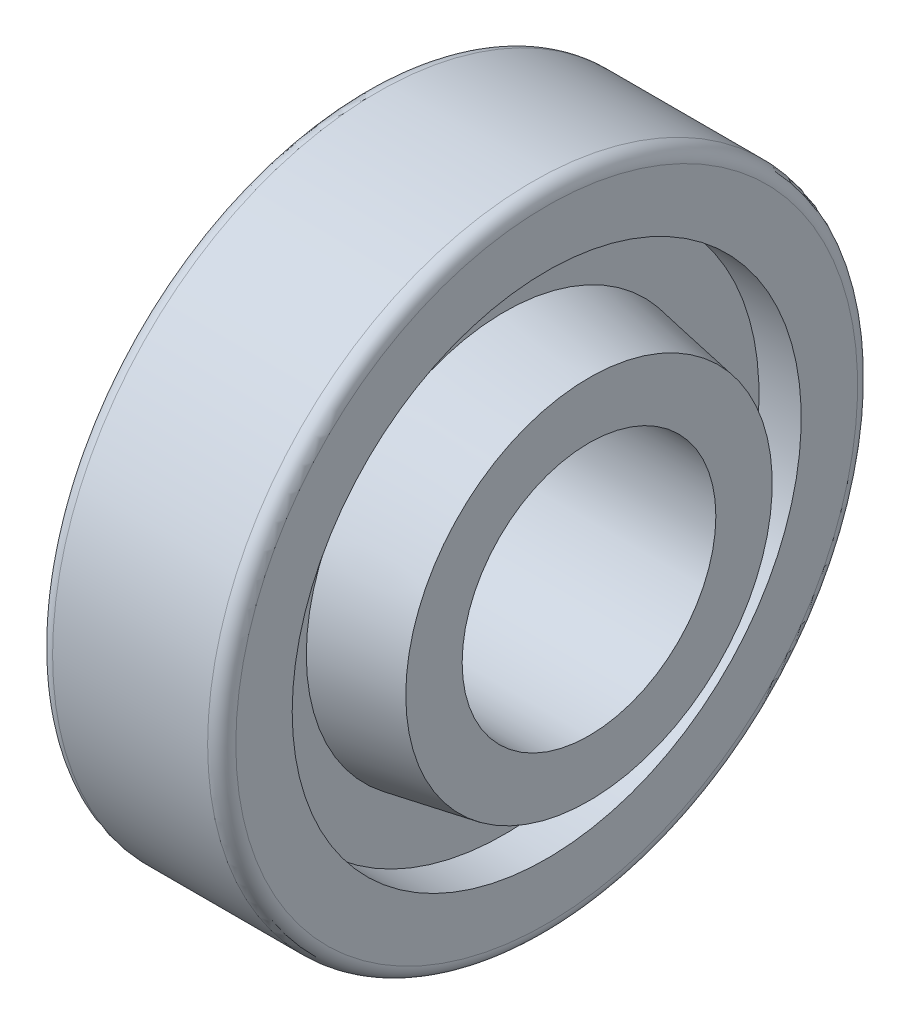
ISO-10303-21;
HEADER;
FILE_DESCRIPTION(('STEP AP214'),'2;1');
FILE_NAME('part.step','',(''),(''),'','','');
FILE_SCHEMA(('AUTOMOTIVE_DESIGN { 1 0 10303 214 1 1 1 1 }'));
ENDSEC;
DATA;
#1=APPLICATION_CONTEXT('core data for automotive mechanical design processes');
#2=APPLICATION_PROTOCOL_DEFINITION('international standard','automotive_design',2000,#1);
#3=PRODUCT_CONTEXT('',#1,'mechanical');
#4=PRODUCT('Part','Part','',(#3));
#5=PRODUCT_RELATED_PRODUCT_CATEGORY('part','',(#4));
#6=PRODUCT_DEFINITION_FORMATION('','',#4);
#7=PRODUCT_DEFINITION_CONTEXT('part definition',#1,'design');
#8=PRODUCT_DEFINITION('design','',#6,#7);
#9=PRODUCT_DEFINITION_SHAPE('','',#8);
#10=(LENGTH_UNIT() NAMED_UNIT(*) SI_UNIT(.MILLI.,.METRE.));
#11=(NAMED_UNIT(*) PLANE_ANGLE_UNIT() SI_UNIT($,.RADIAN.));
#12=(NAMED_UNIT(*) SI_UNIT($,.STERADIAN.) SOLID_ANGLE_UNIT());
#13=UNCERTAINTY_MEASURE_WITH_UNIT(LENGTH_MEASURE(1.E-05),#10,'distance_accuracy_value','');
#14=(GEOMETRIC_REPRESENTATION_CONTEXT(3) GLOBAL_UNCERTAINTY_ASSIGNED_CONTEXT((#13)) GLOBAL_UNIT_ASSIGNED_CONTEXT((#10,
#11,#12)) REPRESENTATION_CONTEXT('',''));
#15=CARTESIAN_POINT('',(0.,0.,0.));
#16=DIRECTION('',(0.,0.,1.));
#17=DIRECTION('',(1.,0.,0.));
#18=AXIS2_PLACEMENT_3D('',#15,#16,#17);
#19=CARTESIAN_POINT('',(-32.5,115.289809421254,0.));
#20=DIRECTION('',(1.,0.,0.));
#21=DIRECTION('',(0.,0.,-1.));
#22=AXIS2_PLACEMENT_3D('',#19,#20,#21);
#23=PLANE('',#22);
#24=CARTESIAN_POINT('',(-32.5,0.,0.));
#25=DIRECTION('',(1.,0.,0.));
#26=DIRECTION('',(0.,0.,-1.));
#27=AXIS2_PLACEMENT_3D('',#24,#25,#26);
#28=CIRCLE('',#27,110.289809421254);
#29=CARTESIAN_POINT('',(-32.5,0.,-110.289809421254));
#30=VERTEX_POINT('',#29);
#31=EDGE_CURVE('E46',#30,#30,#28,.F.);
#32=ORIENTED_EDGE('',*,*,#31,.T.);
#33=EDGE_LOOP('',(#32));
#34=FACE_BOUND('',#33,.T.);
#35=CARTESIAN_POINT('',(-32.5,0.,0.));
#36=DIRECTION('',(-1.,0.,0.));
#37=DIRECTION('',(0.,0.,1.));
#38=AXIS2_PLACEMENT_3D('',#35,#36,#37);
#39=CIRCLE('',#38,90.2898094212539);
#40=CARTESIAN_POINT('',(-32.5,0.,90.2898094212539));
#41=VERTEX_POINT('',#40);
#42=EDGE_CURVE('E51',#41,#41,#39,.T.);
#43=ORIENTED_EDGE('',*,*,#42,.F.);
#44=EDGE_LOOP('',(#43));
#45=FACE_BOUND('',#44,.T.);
#46=ADVANCED_FACE('F31',(#34,#45),#23,.F.);
#47=CARTESIAN_POINT('',(-65.7699390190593,0.,0.));
#48=DIRECTION('',(-1.,0.,0.));
#49=DIRECTION('',(0.,0.,1.));
#50=AXIS2_PLACEMENT_3D('',#47,#48,#49);
#51=CYLINDRICAL_SURFACE('',#50,90.2898094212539);
#52=CARTESIAN_POINT('',(-17.5,0.,0.));
#53=DIRECTION('',(-1.,0.,0.));
#54=DIRECTION('',(0.,0.,1.));
#55=AXIS2_PLACEMENT_3D('',#52,#53,#54);
#56=CIRCLE('',#55,90.2898094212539);
#57=CARTESIAN_POINT('',(-17.5,0.,90.2898094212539));
#58=VERTEX_POINT('',#57);
#59=EDGE_CURVE('E54',#58,#58,#56,.T.);
#60=ORIENTED_EDGE('',*,*,#59,.F.);
#61=EDGE_LOOP('',(#60));
#62=FACE_BOUND('',#61,.T.);
#63=ORIENTED_EDGE('',*,*,#42,.T.);
#64=EDGE_LOOP('',(#63));
#65=FACE_BOUND('',#64,.T.);
#66=ADVANCED_FACE('F129',(#62,#65),#51,.F.);
#67=CARTESIAN_POINT('',(-17.5,90.2898094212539,0.));
#68=DIRECTION('',(1.,0.,0.));
#69=DIRECTION('',(0.,0.,-1.));
#70=AXIS2_PLACEMENT_3D('',#67,#68,#69);
#71=PLANE('',#70);
#72=CARTESIAN_POINT('',(-17.5,0.,0.));
#73=DIRECTION('',(-1.,0.,0.));
#74=DIRECTION('',(0.,0.,1.));
#75=AXIS2_PLACEMENT_3D('',#72,#73,#74);
#76=CIRCLE('',#75,70.2898094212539);
#77=CARTESIAN_POINT('',(-17.5,0.,70.2898094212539));
#78=VERTEX_POINT('',#77);
#79=EDGE_CURVE('E57',#78,#78,#76,.T.);
#80=ORIENTED_EDGE('',*,*,#79,.F.);
#81=EDGE_LOOP('',(#80));
#82=FACE_BOUND('',#81,.T.);
#83=ORIENTED_EDGE('',*,*,#59,.T.);
#84=EDGE_LOOP('',(#83));
#85=FACE_BOUND('',#84,.T.);
#86=ADVANCED_FACE('F123',(#82,#85),#71,.F.);
#87=CARTESIAN_POINT('',(-17.5,0.,0.));
#88=DIRECTION('',(1.,0.,0.));
#89=DIRECTION('',(0.,0.,-1.));
#90=AXIS2_PLACEMENT_3D('',#87,#88,#89);
#91=CONICAL_SURFACE('',#90,70.2898094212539,0.17453292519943);
#92=CARTESIAN_POINT('',(-47.5,0.,0.));
#93=DIRECTION('',(-1.,0.,0.));
#94=DIRECTION('',(0.,0.,1.));
#95=AXIS2_PLACEMENT_3D('',#92,#93,#94);
#96=CIRCLE('',#95,65.);
#97=CARTESIAN_POINT('',(-47.5,0.,65.));
#98=VERTEX_POINT('',#97);
#99=EDGE_CURVE('E60',#98,#98,#96,.T.);
#100=ORIENTED_EDGE('',*,*,#99,.F.);
#101=EDGE_LOOP('',(#100));
#102=FACE_BOUND('',#101,.T.);
#103=ORIENTED_EDGE('',*,*,#79,.T.);
#104=EDGE_LOOP('',(#103));
#105=FACE_BOUND('',#104,.T.);
#106=ADVANCED_FACE('F117',(#102,#105),#91,.T.);
#107=CARTESIAN_POINT('',(-47.5,65.,0.));
#108=DIRECTION('',(1.,0.,0.));
#109=DIRECTION('',(0.,0.,-1.));
#110=AXIS2_PLACEMENT_3D('',#107,#108,#109);
#111=PLANE('',#110);
#112=CARTESIAN_POINT('',(-47.5,0.,0.));
#113=DIRECTION('',(-1.,0.,0.));
#114=DIRECTION('',(0.,0.,1.));
#115=AXIS2_PLACEMENT_3D('',#112,#113,#114);
#116=CIRCLE('',#115,45.);
#117=CARTESIAN_POINT('',(-47.5,0.,45.));
#118=VERTEX_POINT('',#117);
#119=EDGE_CURVE('E63',#118,#118,#116,.T.);
#120=ORIENTED_EDGE('',*,*,#119,.F.);
#121=EDGE_LOOP('',(#120));
#122=FACE_BOUND('',#121,.T.);
#123=ORIENTED_EDGE('',*,*,#99,.T.);
#124=EDGE_LOOP('',(#123));
#125=FACE_BOUND('',#124,.T.);
#126=ADVANCED_FACE('F111',(#122,#125),#111,.F.);
#127=CARTESIAN_POINT('',(-65.7699390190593,0.,0.));
#128=DIRECTION('',(-1.,0.,0.));
#129=DIRECTION('',(0.,0.,1.));
#130=AXIS2_PLACEMENT_3D('',#127,#128,#129);
#131=CYLINDRICAL_SURFACE('',#130,45.);
#132=CARTESIAN_POINT('',(47.5,0.,0.));
#133=DIRECTION('',(-1.,0.,0.));
#134=DIRECTION('',(0.,0.,1.));
#135=AXIS2_PLACEMENT_3D('',#132,#133,#134);
#136=CIRCLE('',#135,45.);
#137=CARTESIAN_POINT('',(47.5,0.,45.));
#138=VERTEX_POINT('',#137);
#139=EDGE_CURVE('E66',#138,#138,#136,.T.);
#140=ORIENTED_EDGE('',*,*,#139,.F.);
#141=EDGE_LOOP('',(#140));
#142=FACE_BOUND('',#141,.T.);
#143=ORIENTED_EDGE('',*,*,#119,.T.);
#144=EDGE_LOOP('',(#143));
#145=FACE_BOUND('',#144,.T.);
#146=ADVANCED_FACE('F105',(#142,#145),#131,.F.);
#147=CARTESIAN_POINT('',(47.5,65.,0.));
#148=DIRECTION('',(-1.,0.,0.));
#149=DIRECTION('',(0.,0.,1.));
#150=AXIS2_PLACEMENT_3D('',#147,#148,#149);
#151=PLANE('',#150);
#152=CARTESIAN_POINT('',(47.5,0.,0.));
#153=DIRECTION('',(-1.,0.,0.));
#154=DIRECTION('',(0.,0.,1.));
#155=AXIS2_PLACEMENT_3D('',#152,#153,#154);
#156=CIRCLE('',#155,65.);
#157=CARTESIAN_POINT('',(47.5,0.,65.));
#158=VERTEX_POINT('',#157);
#159=EDGE_CURVE('E69',#158,#158,#156,.T.);
#160=ORIENTED_EDGE('',*,*,#159,.F.);
#161=EDGE_LOOP('',(#160));
#162=FACE_BOUND('',#161,.T.);
#163=ORIENTED_EDGE('',*,*,#139,.T.);
#164=EDGE_LOOP('',(#163));
#165=FACE_BOUND('',#164,.T.);
#166=ADVANCED_FACE('F99',(#162,#165),#151,.F.);
#167=CARTESIAN_POINT('',(47.5,0.,0.));
#168=DIRECTION('',(-1.,0.,0.));
#169=DIRECTION('',(0.,0.,1.));
#170=AXIS2_PLACEMENT_3D('',#167,#168,#169);
#171=CONICAL_SURFACE('',#170,65.,0.17453292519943);
#172=CARTESIAN_POINT('',(17.5,0.,0.));
#173=DIRECTION('',(-1.,0.,0.));
#174=DIRECTION('',(0.,0.,1.));
#175=AXIS2_PLACEMENT_3D('',#172,#173,#174);
#176=CIRCLE('',#175,70.2898094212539);
#177=CARTESIAN_POINT('',(17.5,0.,70.2898094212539));
#178=VERTEX_POINT('',#177);
#179=EDGE_CURVE('E72',#178,#178,#176,.T.);
#180=ORIENTED_EDGE('',*,*,#179,.F.);
#181=EDGE_LOOP('',(#180));
#182=FACE_BOUND('',#181,.T.);
#183=ORIENTED_EDGE('',*,*,#159,.T.);
#184=EDGE_LOOP('',(#183));
#185=FACE_BOUND('',#184,.T.);
#186=ADVANCED_FACE('F93',(#182,#185),#171,.T.);
#187=CARTESIAN_POINT('',(17.5,90.2898094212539,0.));
#188=DIRECTION('',(-1.,0.,0.));
#189=DIRECTION('',(0.,0.,1.));
#190=AXIS2_PLACEMENT_3D('',#187,#188,#189);
#191=PLANE('',#190);
#192=CARTESIAN_POINT('',(17.5,0.,0.));
#193=DIRECTION('',(-1.,0.,0.));
#194=DIRECTION('',(0.,0.,1.));
#195=AXIS2_PLACEMENT_3D('',#192,#193,#194);
#196=CIRCLE('',#195,90.2898094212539);
#197=CARTESIAN_POINT('',(17.5,0.,90.2898094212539));
#198=VERTEX_POINT('',#197);
#199=EDGE_CURVE('E75',#198,#198,#196,.T.);
#200=ORIENTED_EDGE('',*,*,#199,.F.);
#201=EDGE_LOOP('',(#200));
#202=FACE_BOUND('',#201,.T.);
#203=ORIENTED_EDGE('',*,*,#179,.T.);
#204=EDGE_LOOP('',(#203));
#205=FACE_BOUND('',#204,.T.);
#206=ADVANCED_FACE('F87',(#202,#205),#191,.F.);
#207=CARTESIAN_POINT('',(-65.7699390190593,0.,0.));
#208=DIRECTION('',(-1.,0.,0.));
#209=DIRECTION('',(0.,0.,1.));
#210=AXIS2_PLACEMENT_3D('',#207,#208,#209);
#211=CYLINDRICAL_SURFACE('',#210,90.2898094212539);
#212=CARTESIAN_POINT('',(32.5,0.,0.));
#213=DIRECTION('',(-1.,0.,0.));
#214=DIRECTION('',(0.,0.,1.));
#215=AXIS2_PLACEMENT_3D('',#212,#213,#214);
#216=CIRCLE('',#215,90.2898094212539);
#217=CARTESIAN_POINT('',(32.5,0.,90.2898094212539));
#218=VERTEX_POINT('',#217);
#219=EDGE_CURVE('E78',#218,#218,#216,.T.);
#220=ORIENTED_EDGE('',*,*,#219,.F.);
#221=EDGE_LOOP('',(#220));
#222=FACE_BOUND('',#221,.T.);
#223=ORIENTED_EDGE('',*,*,#199,.T.);
#224=EDGE_LOOP('',(#223));
#225=FACE_BOUND('',#224,.T.);
#226=ADVANCED_FACE('F84',(#222,#225),#211,.F.);
#227=CARTESIAN_POINT('',(32.5,115.289809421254,0.));
#228=DIRECTION('',(-1.,0.,0.));
#229=DIRECTION('',(0.,0.,1.));
#230=AXIS2_PLACEMENT_3D('',#227,#228,#229);
#231=PLANE('',#230);
#232=CARTESIAN_POINT('',(32.5,0.,0.));
#233=DIRECTION('',(-1.,0.,0.));
#234=DIRECTION('',(0.,0.,1.));
#235=AXIS2_PLACEMENT_3D('',#232,#233,#234);
#236=CIRCLE('',#235,110.289809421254);
#237=CARTESIAN_POINT('',(32.5,0.,110.289809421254));
#238=VERTEX_POINT('',#237);
#239=EDGE_CURVE('E10',#238,#238,#236,.F.);
#240=ORIENTED_EDGE('',*,*,#239,.T.);
#241=EDGE_LOOP('',(#240));
#242=FACE_BOUND('',#241,.T.);
#243=ORIENTED_EDGE('',*,*,#219,.T.);
#244=EDGE_LOOP('',(#243));
#245=FACE_BOUND('',#244,.T.);
#246=ADVANCED_FACE('F82',(#242,#245),#231,.F.);
#247=CARTESIAN_POINT('',(-65.7699390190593,0.,0.));
#248=DIRECTION('',(-1.,0.,0.));
#249=DIRECTION('',(0.,0.,1.));
#250=AXIS2_PLACEMENT_3D('',#247,#248,#249);
#251=CYLINDRICAL_SURFACE('',#250,115.289809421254);
#252=CARTESIAN_POINT('',(-27.5,0.,0.));
#253=DIRECTION('',(1.,0.,0.));
#254=DIRECTION('',(0.,0.,-1.));
#255=AXIS2_PLACEMENT_3D('',#252,#253,#254);
#256=CIRCLE('',#255,115.289809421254);
#257=CARTESIAN_POINT('',(-27.5,0.,-115.289809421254));
#258=VERTEX_POINT('',#257);
#259=EDGE_CURVE('E38',#258,#258,#256,.T.);
#260=ORIENTED_EDGE('',*,*,#259,.T.);
#261=EDGE_LOOP('',(#260));
#262=FACE_BOUND('',#261,.T.);
#263=CARTESIAN_POINT('',(27.5,0.,0.));
#264=DIRECTION('',(-1.,0.,0.));
#265=DIRECTION('',(0.,0.,1.));
#266=AXIS2_PLACEMENT_3D('',#263,#264,#265);
#267=CIRCLE('',#266,115.289809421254);
#268=CARTESIAN_POINT('',(27.5,0.,115.289809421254));
#269=VERTEX_POINT('',#268);
#270=EDGE_CURVE('E42',#269,#269,#267,.T.);
#271=ORIENTED_EDGE('',*,*,#270,.T.);
#272=EDGE_LOOP('',(#271));
#273=FACE_BOUND('',#272,.T.);
#274=ADVANCED_FACE('F147',(#262,#273),#251,.T.);
#275=CARTESIAN_POINT('',(-27.5,0.,0.));
#276=DIRECTION('',(1.,0.,0.));
#277=DIRECTION('',(0.,0.,-1.));
#278=AXIS2_PLACEMENT_3D('',#275,#276,#277);
#279=TOROIDAL_SURFACE('',#278,110.289809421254,5.);
#280=ORIENTED_EDGE('',*,*,#259,.F.);
#281=EDGE_LOOP('',(#280));
#282=FACE_BOUND('',#281,.T.);
#283=ORIENTED_EDGE('',*,*,#31,.F.);
#284=EDGE_LOOP('',(#283));
#285=FACE_BOUND('',#284,.T.);
#286=ADVANCED_FACE('F145',(#282,#285),#279,.T.);
#287=CARTESIAN_POINT('',(27.5,0.,0.));
#288=DIRECTION('',(-1.,0.,0.));
#289=DIRECTION('',(0.,0.,1.));
#290=AXIS2_PLACEMENT_3D('',#287,#288,#289);
#291=TOROIDAL_SURFACE('',#290,110.289809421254,5.);
#292=ORIENTED_EDGE('',*,*,#239,.F.);
#293=EDGE_LOOP('',(#292));
#294=FACE_BOUND('',#293,.T.);
#295=ORIENTED_EDGE('',*,*,#270,.F.);
#296=EDGE_LOOP('',(#295));
#297=FACE_BOUND('',#296,.T.);
#298=ADVANCED_FACE('F33',(#294,#297),#291,.T.);
#299=CLOSED_SHELL('',(#46,#66,#86,#106,#126,#146,#166,#186,#206,#226,#246,#274,#286,#298));
#300=MANIFOLD_SOLID_BREP('B2',#299);
#301=ADVANCED_BREP_SHAPE_REPRESENTATION('',(#18,#300),#14);
#302=SHAPE_DEFINITION_REPRESENTATION(#9,#301);
ENDSEC;
END-ISO-10303-21;
